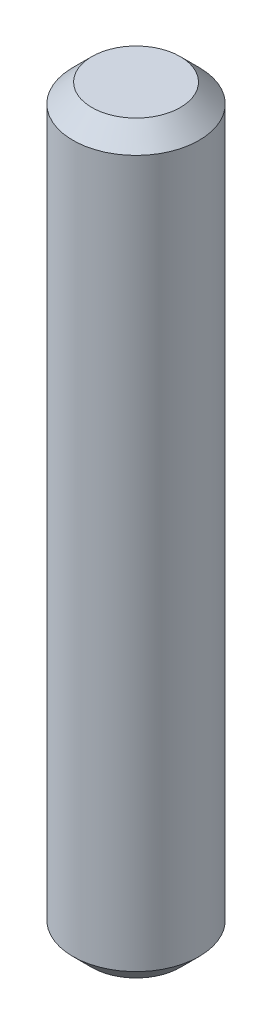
ISO-10303-21;
HEADER;
FILE_DESCRIPTION(('STEP AP214'),'2;1');
FILE_NAME('part.step','',(''),(''),'','','');
FILE_SCHEMA(('AUTOMOTIVE_DESIGN { 1 0 10303 214 1 1 1 1 }'));
ENDSEC;
DATA;
#1=APPLICATION_CONTEXT('core data for automotive mechanical design processes');
#2=APPLICATION_PROTOCOL_DEFINITION('international standard','automotive_design',2000,#1);
#3=PRODUCT_CONTEXT('',#1,'mechanical');
#4=PRODUCT('Part','Part','',(#3));
#5=PRODUCT_RELATED_PRODUCT_CATEGORY('part','',(#4));
#6=PRODUCT_DEFINITION_FORMATION('','',#4);
#7=PRODUCT_DEFINITION_CONTEXT('part definition',#1,'design');
#8=PRODUCT_DEFINITION('design','',#6,#7);
#9=PRODUCT_DEFINITION_SHAPE('','',#8);
#10=(LENGTH_UNIT() NAMED_UNIT(*) SI_UNIT(.MILLI.,.METRE.));
#11=(NAMED_UNIT(*) PLANE_ANGLE_UNIT() SI_UNIT($,.RADIAN.));
#12=(NAMED_UNIT(*) SI_UNIT($,.STERADIAN.) SOLID_ANGLE_UNIT());
#13=UNCERTAINTY_MEASURE_WITH_UNIT(LENGTH_MEASURE(1.E-05),#10,'distance_accuracy_value','');
#14=(GEOMETRIC_REPRESENTATION_CONTEXT(3) GLOBAL_UNCERTAINTY_ASSIGNED_CONTEXT((#13)) GLOBAL_UNIT_ASSIGNED_CONTEXT((#10,
#11,#12)) REPRESENTATION_CONTEXT('',''));
#15=CARTESIAN_POINT('',(0.,0.,0.));
#16=DIRECTION('',(0.,0.,1.));
#17=DIRECTION('',(1.,0.,0.));
#18=AXIS2_PLACEMENT_3D('',#15,#16,#17);
#19=CARTESIAN_POINT('',(0.,11.8,0.));
#20=DIRECTION('',(0.,-1.,0.));
#21=DIRECTION('',(0.,0.,-0.999999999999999));
#22=AXIS2_PLACEMENT_3D('',#19,#20,#21);
#23=CYLINDRICAL_SURFACE('',#22,1.);
#24=CARTESIAN_POINT('',(0.,11.5,0.));
#25=DIRECTION('',(0.,1.,0.));
#26=DIRECTION('',(0.,0.,0.999999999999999));
#27=AXIS2_PLACEMENT_3D('',#24,#25,#26);
#28=CIRCLE('',#27,1.);
#29=CARTESIAN_POINT('',(0.,11.5,-1.));
#30=VERTEX_POINT('',#29);
#31=EDGE_CURVE('E26',#30,#30,#28,.F.);
#32=CARTESIAN_POINT('',(0.,0.300000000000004,0.));
#33=DIRECTION('',(0.,1.,0.));
#34=DIRECTION('',(0.,0.,0.999999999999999));
#35=AXIS2_PLACEMENT_3D('',#32,#33,#34);
#36=CIRCLE('',#35,1.);
#37=CARTESIAN_POINT('',(0.,0.300000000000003,-1.));
#38=VERTEX_POINT('',#37);
#39=EDGE_CURVE('E30',#38,#38,#36,.T.);
#40=CARTESIAN_POINT('',(0.,11.5,-1.));
#41=CARTESIAN_POINT('',(0.,11.3833333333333,-1.));
#42=CARTESIAN_POINT('',(0.,11.2666666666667,-1.));
#43=CARTESIAN_POINT('',(0.,11.0333333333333,-1.));
#44=CARTESIAN_POINT('',(0.,10.9166666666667,-1.));
#45=CARTESIAN_POINT('',(0.,10.6833333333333,-1.));
#46=CARTESIAN_POINT('',(0.,10.5666666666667,-1.));
#47=CARTESIAN_POINT('',(0.,10.3333333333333,-1.));
#48=CARTESIAN_POINT('',(0.,10.2166666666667,-1.));
#49=CARTESIAN_POINT('',(0.,9.98333333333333,-1.));
#50=CARTESIAN_POINT('',(0.,9.86666666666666,-1.));
#51=CARTESIAN_POINT('',(0.,9.63333333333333,-1.));
#52=CARTESIAN_POINT('',(0.,9.51666666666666,-1.));
#53=CARTESIAN_POINT('',(0.,9.28333333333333,-1.));
#54=CARTESIAN_POINT('',(0.,9.16666666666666,-1.));
#55=CARTESIAN_POINT('',(0.,8.93333333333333,-1.));
#56=CARTESIAN_POINT('',(0.,8.81666666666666,-1.));
#57=CARTESIAN_POINT('',(0.,8.58333333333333,-1.));
#58=CARTESIAN_POINT('',(0.,8.46666666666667,-1.));
#59=CARTESIAN_POINT('',(0.,8.23333333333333,-1.));
#60=CARTESIAN_POINT('',(0.,8.11666666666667,-1.));
#61=CARTESIAN_POINT('',(0.,7.88333333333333,-1.));
#62=CARTESIAN_POINT('',(0.,7.76666666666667,-1.));
#63=CARTESIAN_POINT('',(0.,7.53333333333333,-1.));
#64=CARTESIAN_POINT('',(0.,7.41666666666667,-1.));
#65=CARTESIAN_POINT('',(0.,7.18333333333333,-1.));
#66=CARTESIAN_POINT('',(0.,7.06666666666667,-1.));
#67=CARTESIAN_POINT('',(0.,6.83333333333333,-1.));
#68=CARTESIAN_POINT('',(0.,6.71666666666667,-1.));
#69=CARTESIAN_POINT('',(0.,6.48333333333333,-1.));
#70=CARTESIAN_POINT('',(0.,6.36666666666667,-1.));
#71=CARTESIAN_POINT('',(0.,6.13333333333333,-1.));
#72=CARTESIAN_POINT('',(0.,6.01666666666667,-1.));
#73=CARTESIAN_POINT('',(0.,5.78333333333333,-1.));
#74=CARTESIAN_POINT('',(0.,5.66666666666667,-1.));
#75=CARTESIAN_POINT('',(0.,5.43333333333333,-1.));
#76=CARTESIAN_POINT('',(0.,5.31666666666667,-1.));
#77=CARTESIAN_POINT('',(0.,5.08333333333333,-1.));
#78=CARTESIAN_POINT('',(0.,4.96666666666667,-1.));
#79=CARTESIAN_POINT('',(0.,4.73333333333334,-1.));
#80=CARTESIAN_POINT('',(0.,4.61666666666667,-1.));
#81=CARTESIAN_POINT('',(0.,4.38333333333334,-1.));
#82=CARTESIAN_POINT('',(0.,4.26666666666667,-1.));
#83=CARTESIAN_POINT('',(0.,4.03333333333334,-1.));
#84=CARTESIAN_POINT('',(0.,3.91666666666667,-1.));
#85=CARTESIAN_POINT('',(0.,3.68333333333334,-1.));
#86=CARTESIAN_POINT('',(0.,3.56666666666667,-1.));
#87=CARTESIAN_POINT('',(0.,3.33333333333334,-1.));
#88=CARTESIAN_POINT('',(0.,3.21666666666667,-1.));
#89=CARTESIAN_POINT('',(0.,2.98333333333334,-1.));
#90=CARTESIAN_POINT('',(0.,2.86666666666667,-1.));
#91=CARTESIAN_POINT('',(0.,2.63333333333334,-1.));
#92=CARTESIAN_POINT('',(0.,2.51666666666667,-1.));
#93=CARTESIAN_POINT('',(0.,2.28333333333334,-1.));
#94=CARTESIAN_POINT('',(0.,2.16666666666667,-1.));
#95=CARTESIAN_POINT('',(0.,1.93333333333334,-1.));
#96=CARTESIAN_POINT('',(0.,1.81666666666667,-1.));
#97=CARTESIAN_POINT('',(0.,1.58333333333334,-1.));
#98=CARTESIAN_POINT('',(0.,1.46666666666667,-1.));
#99=CARTESIAN_POINT('',(0.,1.23333333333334,-1.));
#100=CARTESIAN_POINT('',(0.,1.11666666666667,-1.));
#101=CARTESIAN_POINT('',(0.,0.883333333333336,-1.));
#102=CARTESIAN_POINT('',(0.,0.766666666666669,-1.));
#103=CARTESIAN_POINT('',(0.,0.533333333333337,-1.));
#104=CARTESIAN_POINT('',(0.,0.41666666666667,-1.));
#105=CARTESIAN_POINT('',(0.,0.300000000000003,-1.));
#106=B_SPLINE_CURVE_WITH_KNOTS('',3,(#40,#41,#42,#43,#44,#45,#46,#47,#48,#49,#50,#51,#52,#53,
#54,#55,#56,#57,#58,#59,#60,#61,#62,#63,#64,#65,#66,#67,#68,#69,#70,#71,#72,#73,#74,#75,#76,#77,
#78,#79,#80,#81,#82,#83,#84,#85,#86,#87,#88,#89,#90,#91,#92,#93,#94,#95,#96,#97,#98,#99,#100,
#101,#102,#103,#104,#105),.UNSPECIFIED.,.F.,.F.,(4,2,2,2,2,2,2,2,2,2,2,2,2,2,2,2,2,2,2,2,2,2,2,
2,2,2,2,2,2,2,2,2,4),(0.,0.35,0.699999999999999,1.05,1.4,1.75,2.1,2.45,2.8,3.15,3.5,3.85,4.2,
4.55,4.9,5.25,5.6,5.94999999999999,6.29999999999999,6.64999999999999,6.99999999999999,
7.34999999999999,7.69999999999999,8.05,8.4,8.74999999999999,9.09999999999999,9.44999999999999,
9.79999999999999,10.15,10.5,10.85,11.2),.UNSPECIFIED.);
#107=EDGE_CURVE('BSEAM20',#30,#38,#106,.T.);
#108=ORIENTED_EDGE('',*,*,#31,.T.);
#109=ORIENTED_EDGE('',*,*,#39,.T.);
#110=ORIENTED_EDGE('',*,*,#107,.T.);
#111=ORIENTED_EDGE('',*,*,#107,.F.);
#112=EDGE_LOOP('',(#108,#110,#109,#111));
#113=FACE_BOUND('',#112,.T.);
#114=ADVANCED_FACE('F20',(#113),#23,.T.);
#115=CARTESIAN_POINT('',(0.,11.8,0.));
#116=DIRECTION('',(0.,1.,0.));
#117=DIRECTION('',(0.,0.,0.999999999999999));
#118=AXIS2_PLACEMENT_3D('',#115,#116,#117);
#119=PLANE('',#118);
#120=CARTESIAN_POINT('',(0.,11.8,0.));
#121=DIRECTION('',(0.,1.,0.));
#122=DIRECTION('',(0.,0.,0.999999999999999));
#123=AXIS2_PLACEMENT_3D('',#120,#121,#122);
#124=CIRCLE('',#123,0.699999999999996);
#125=CARTESIAN_POINT('',(0.,11.8,-0.7));
#126=VERTEX_POINT('',#125);
#127=EDGE_CURVE('E34',#126,#126,#124,.T.);
#128=ORIENTED_EDGE('',*,*,#127,.T.);
#129=EDGE_LOOP('',(#128));
#130=FACE_BOUND('',#129,.T.);
#131=ADVANCED_FACE('F40',(#130),#119,.T.);
#132=CARTESIAN_POINT('',(0.,0.,0.));
#133=DIRECTION('',(0.,1.,0.));
#134=DIRECTION('',(0.,0.,0.999999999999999));
#135=AXIS2_PLACEMENT_3D('',#132,#133,#134);
#136=PLANE('',#135);
#137=CARTESIAN_POINT('',(0.,0.,0.));
#138=DIRECTION('',(0.,1.,0.));
#139=DIRECTION('',(0.,0.,0.999999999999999));
#140=AXIS2_PLACEMENT_3D('',#137,#138,#139);
#141=CIRCLE('',#140,0.699999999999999);
#142=CARTESIAN_POINT('',(0.,0.,0.699999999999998));
#143=VERTEX_POINT('',#142);
#144=EDGE_CURVE('E10',#143,#143,#141,.F.);
#145=ORIENTED_EDGE('',*,*,#144,.T.);
#146=EDGE_LOOP('',(#145));
#147=FACE_BOUND('',#146,.T.);
#148=ADVANCED_FACE('F45',(#147),#136,.F.);
#149=CARTESIAN_POINT('',(0.,11.8,0.));
#150=DIRECTION('',(0.,-1.,0.));
#151=DIRECTION('',(0.,0.,-0.999999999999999));
#152=AXIS2_PLACEMENT_3D('',#149,#150,#151);
#153=CONICAL_SURFACE('',#152,0.699999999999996,0.785398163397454);
#154=CARTESIAN_POINT('',(0.,11.5,-1.));
#155=CARTESIAN_POINT('',(0.,11.503125,-0.996875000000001));
#156=CARTESIAN_POINT('',(0.,11.50625,-0.993750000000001));
#157=CARTESIAN_POINT('',(0.,11.5125,-0.987500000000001));
#158=CARTESIAN_POINT('',(0.,11.515625,-0.984375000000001));
#159=CARTESIAN_POINT('',(0.,11.521875,-0.978125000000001));
#160=CARTESIAN_POINT('',(0.,11.525,-0.975000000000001));
#161=CARTESIAN_POINT('',(0.,11.53125,-0.968750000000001));
#162=CARTESIAN_POINT('',(0.,11.534375,-0.965625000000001));
#163=CARTESIAN_POINT('',(0.,11.540625,-0.959375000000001));
#164=CARTESIAN_POINT('',(0.,11.54375,-0.956250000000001));
#165=CARTESIAN_POINT('',(0.,11.55,-0.950000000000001));
#166=CARTESIAN_POINT('',(0.,11.553125,-0.946875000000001));
#167=CARTESIAN_POINT('',(0.,11.559375,-0.940625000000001));
#168=CARTESIAN_POINT('',(0.,11.5625,-0.937500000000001));
#169=CARTESIAN_POINT('',(0.,11.56875,-0.931250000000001));
#170=CARTESIAN_POINT('',(0.,11.571875,-0.928125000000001));
#171=CARTESIAN_POINT('',(0.,11.578125,-0.921875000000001));
#172=CARTESIAN_POINT('',(0.,11.58125,-0.918750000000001));
#173=CARTESIAN_POINT('',(0.,11.5875,-0.912500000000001));
#174=CARTESIAN_POINT('',(0.,11.590625,-0.909375));
#175=CARTESIAN_POINT('',(0.,11.596875,-0.903125));
#176=CARTESIAN_POINT('',(0.,11.6,-0.900000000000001));
#177=CARTESIAN_POINT('',(0.,11.60625,-0.893750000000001));
#178=CARTESIAN_POINT('',(0.,11.609375,-0.890625));
#179=CARTESIAN_POINT('',(0.,11.615625,-0.884375));
#180=CARTESIAN_POINT('',(0.,11.61875,-0.881250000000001));
#181=CARTESIAN_POINT('',(0.,11.625,-0.875000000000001));
#182=CARTESIAN_POINT('',(0.,11.628125,-0.871875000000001));
#183=CARTESIAN_POINT('',(0.,11.634375,-0.865625));
#184=CARTESIAN_POINT('',(0.,11.6375,-0.8625));
#185=CARTESIAN_POINT('',(0.,11.64375,-0.856250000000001));
#186=CARTESIAN_POINT('',(0.,11.646875,-0.853125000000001));
#187=CARTESIAN_POINT('',(0.,11.653125,-0.846875));
#188=CARTESIAN_POINT('',(0.,11.65625,-0.84375));
#189=CARTESIAN_POINT('',(0.,11.6625,-0.8375));
#190=CARTESIAN_POINT('',(0.,11.665625,-0.834375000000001));
#191=CARTESIAN_POINT('',(0.,11.671875,-0.828125));
#192=CARTESIAN_POINT('',(0.,11.675,-0.825));
#193=CARTESIAN_POINT('',(0.,11.68125,-0.81875));
#194=CARTESIAN_POINT('',(0.,11.684375,-0.815625));
#195=CARTESIAN_POINT('',(0.,11.690625,-0.809375));
#196=CARTESIAN_POINT('',(0.,11.69375,-0.80625));
#197=CARTESIAN_POINT('',(0.,11.7,-0.8));
#198=CARTESIAN_POINT('',(0.,11.703125,-0.796875));
#199=CARTESIAN_POINT('',(0.,11.709375,-0.790625));
#200=CARTESIAN_POINT('',(0.,11.7125,-0.7875));
#201=CARTESIAN_POINT('',(0.,11.71875,-0.78125));
#202=CARTESIAN_POINT('',(0.,11.721875,-0.778125));
#203=CARTESIAN_POINT('',(0.,11.728125,-0.771875));
#204=CARTESIAN_POINT('',(0.,11.73125,-0.76875));
#205=CARTESIAN_POINT('',(0.,11.7375,-0.7625));
#206=CARTESIAN_POINT('',(0.,11.740625,-0.759375));
#207=CARTESIAN_POINT('',(0.,11.746875,-0.753125));
#208=CARTESIAN_POINT('',(0.,11.75,-0.75));
#209=CARTESIAN_POINT('',(0.,11.75625,-0.74375));
#210=CARTESIAN_POINT('',(0.,11.759375,-0.740625));
#211=CARTESIAN_POINT('',(0.,11.765625,-0.734375));
#212=CARTESIAN_POINT('',(0.,11.76875,-0.73125));
#213=CARTESIAN_POINT('',(0.,11.775,-0.725));
#214=CARTESIAN_POINT('',(0.,11.778125,-0.721875));
#215=CARTESIAN_POINT('',(0.,11.784375,-0.715625));
#216=CARTESIAN_POINT('',(0.,11.7875,-0.712499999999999));
#217=CARTESIAN_POINT('',(0.,11.79375,-0.70625));
#218=CARTESIAN_POINT('',(0.,11.796875,-0.703125));
#219=CARTESIAN_POINT('',(0.,11.8,-0.7));
#220=B_SPLINE_CURVE_WITH_KNOTS('',3,(#154,#155,#156,#157,#158,#159,#160,#161,#162,#163,#164,
#165,#166,#167,#168,#169,#170,#171,#172,#173,#174,#175,#176,#177,#178,#179,#180,#181,#182,#183,
#184,#185,#186,#187,#188,#189,#190,#191,#192,#193,#194,#195,#196,#197,#198,#199,#200,#201,#202,
#203,#204,#205,#206,#207,#208,#209,#210,#211,#212,#213,#214,#215,#216,#217,#218,#219),
.UNSPECIFIED.,.F.,.F.,(4,2,2,2,2,2,2,2,2,2,2,2,2,2,2,2,2,2,2,2,2,2,2,2,2,2,2,2,2,2,2,2,4),(0.,
0.0132582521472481,0.0265165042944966,0.0397747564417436,0.0530330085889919,0.066291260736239,
0.0795495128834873,0.0928077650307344,0.106066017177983,0.119324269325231,0.132582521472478,
0.145840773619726,0.159099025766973,0.172357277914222,0.185615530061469,0.198873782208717,
0.212132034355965,0.225390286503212,0.238648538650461,0.251906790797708,0.265165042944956,
0.278423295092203,0.291681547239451,0.304939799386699,0.318198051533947,0.331456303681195,
0.344714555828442,0.357972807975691,0.371231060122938,0.384489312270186,0.397747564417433,
0.411005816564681,0.42426406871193),.UNSPECIFIED.);
#221=EDGE_CURVE('BSEAM42',#30,#126,#220,.T.);
#222=ORIENTED_EDGE('',*,*,#31,.F.);
#223=ORIENTED_EDGE('',*,*,#127,.F.);
#224=ORIENTED_EDGE('',*,*,#221,.T.);
#225=ORIENTED_EDGE('',*,*,#221,.F.);
#226=EDGE_LOOP('',(#222,#224,#223,#225));
#227=FACE_BOUND('',#226,.T.);
#228=ADVANCED_FACE('F42',(#227),#153,.T.);
#229=CARTESIAN_POINT('',(0.,0.300000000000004,0.));
#230=DIRECTION('',(0.,1.,0.));
#231=DIRECTION('',(0.,0.,0.999999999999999));
#232=AXIS2_PLACEMENT_3D('',#229,#230,#231);
#233=CONICAL_SURFACE('',#232,1.,0.785398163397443);
#234=ORIENTED_EDGE('',*,*,#144,.F.);
#235=EDGE_LOOP('',(#234));
#236=FACE_BOUND('',#235,.T.);
#237=ORIENTED_EDGE('',*,*,#39,.F.);
#238=EDGE_LOOP('',(#237));
#239=FACE_BOUND('',#238,.T.);
#240=ADVANCED_FACE('F44',(#236,#239),#233,.T.);
#241=CLOSED_SHELL('',(#114,#131,#148,#228,#240));
#242=MANIFOLD_SOLID_BREP('B2',#241);
#243=ADVANCED_BREP_SHAPE_REPRESENTATION('',(#18,#242),#14);
#244=SHAPE_DEFINITION_REPRESENTATION(#9,#243);
ENDSEC;
END-ISO-10303-21;
